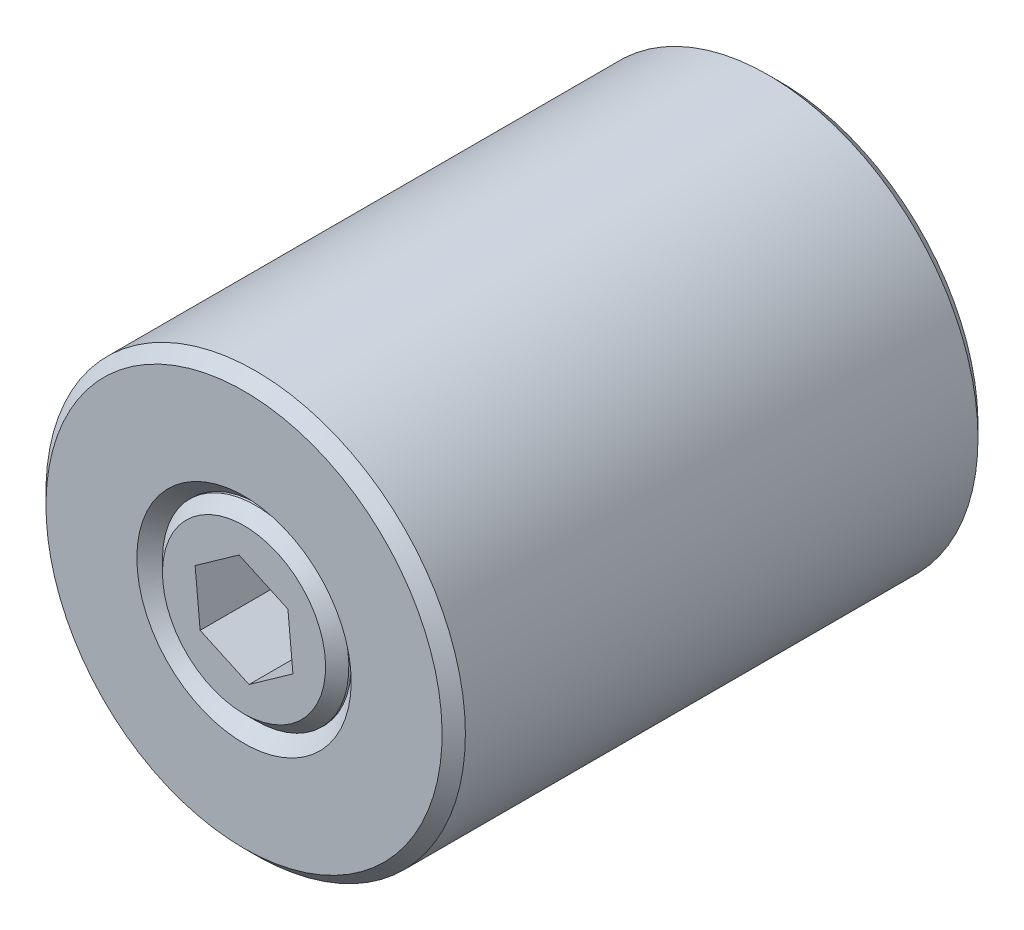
ISO-10303-21;
HEADER;
FILE_DESCRIPTION(('STEP AP214'),'2;1');
FILE_NAME('part.step','',(''),(''),'','','');
FILE_SCHEMA(('AUTOMOTIVE_DESIGN { 1 0 10303 214 1 1 1 1 }'));
ENDSEC;
DATA;
#1=APPLICATION_CONTEXT('core data for automotive mechanical design processes');
#2=APPLICATION_PROTOCOL_DEFINITION('international standard','automotive_design',2000,#1);
#3=PRODUCT_CONTEXT('',#1,'mechanical');
#4=PRODUCT('Part','Part','',(#3));
#5=PRODUCT_RELATED_PRODUCT_CATEGORY('part','',(#4));
#6=PRODUCT_DEFINITION_FORMATION('','',#4);
#7=PRODUCT_DEFINITION_CONTEXT('part definition',#1,'design');
#8=PRODUCT_DEFINITION('design','',#6,#7);
#9=PRODUCT_DEFINITION_SHAPE('','',#8);
#10=(LENGTH_UNIT() NAMED_UNIT(*) SI_UNIT(.MILLI.,.METRE.));
#11=(NAMED_UNIT(*) PLANE_ANGLE_UNIT() SI_UNIT($,.RADIAN.));
#12=(NAMED_UNIT(*) SI_UNIT($,.STERADIAN.) SOLID_ANGLE_UNIT());
#13=UNCERTAINTY_MEASURE_WITH_UNIT(LENGTH_MEASURE(1.E-05),#10,'distance_accuracy_value','');
#14=(GEOMETRIC_REPRESENTATION_CONTEXT(3) GLOBAL_UNCERTAINTY_ASSIGNED_CONTEXT((#13)) GLOBAL_UNIT_ASSIGNED_CONTEXT((#10,
#11,#12)) REPRESENTATION_CONTEXT('',''));
#15=CARTESIAN_POINT('',(0.,0.,0.));
#16=DIRECTION('',(0.,0.,1.));
#17=DIRECTION('',(1.,0.,0.));
#18=AXIS2_PLACEMENT_3D('',#15,#16,#17);
#19=CARTESIAN_POINT('',(2.31410239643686,-3.2626569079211,19.));
#20=DIRECTION('',(0.,0.,1.));
#21=DIRECTION('',(-0.99564874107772,-0.0931857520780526,0.));
#22=AXIS2_PLACEMENT_3D('',#19,#20,#21);
#23=PLANE('',#22);
#24=DIRECTION('',(0.908849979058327,-0.417123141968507,0.));
#25=VECTOR('',#24,1.);
#26=CARTESIAN_POINT('',(-1.88369584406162,-1.33604764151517,19.));
#27=LINE('',#26,#25);
#28=CARTESIAN_POINT('',(-1.88369584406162,-1.33604764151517,19.));
#29=VERTEX_POINT('',#28);
#30=CARTESIAN_POINT('',(0.21520327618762,-2.29935227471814,19.));
#31=VERTEX_POINT('',#30);
#32=EDGE_CURVE('E102',#29,#31,#27,.T.);
#33=ORIENTED_EDGE('',*,*,#32,.T.);
#34=DIRECTION('',(0.815664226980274,0.578525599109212,0.));
#35=VECTOR('',#34,1.);
#36=CARTESIAN_POINT('',(0.21520327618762,-2.29935227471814,19.));
#37=LINE('',#36,#35);
#38=CARTESIAN_POINT('',(2.09889912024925,-0.963304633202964,19.));
#39=VERTEX_POINT('',#38);
#40=EDGE_CURVE('E105',#31,#39,#37,.T.);
#41=ORIENTED_EDGE('',*,*,#40,.T.);
#42=DIRECTION('',(-0.0931857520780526,0.99564874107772,0.));
#43=VECTOR('',#42,1.);
#44=CARTESIAN_POINT('',(2.09889912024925,-0.963304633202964,19.));
#45=LINE('',#44,#43);
#46=CARTESIAN_POINT('',(1.88369584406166,1.33604764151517,19.));
#47=VERTEX_POINT('',#46);
#48=EDGE_CURVE('E77',#39,#47,#45,.T.);
#49=ORIENTED_EDGE('',*,*,#48,.T.);
#50=DIRECTION('',(-0.908849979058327,0.417123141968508,0.));
#51=VECTOR('',#50,1.);
#52=CARTESIAN_POINT('',(1.88369584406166,1.33604764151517,19.));
#53=LINE('',#52,#51);
#54=CARTESIAN_POINT('',(-0.215203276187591,2.29935227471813,19.));
#55=VERTEX_POINT('',#54);
#56=EDGE_CURVE('E108',#47,#55,#53,.T.);
#57=ORIENTED_EDGE('',*,*,#56,.T.);
#58=DIRECTION('',(-0.815664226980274,-0.578525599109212,0.));
#59=VECTOR('',#58,1.);
#60=CARTESIAN_POINT('',(-0.215203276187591,2.29935227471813,19.));
#61=LINE('',#60,#59);
#62=CARTESIAN_POINT('',(-2.09889912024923,0.963304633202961,19.));
#63=VERTEX_POINT('',#62);
#64=EDGE_CURVE('E111',#55,#63,#61,.T.);
#65=ORIENTED_EDGE('',*,*,#64,.T.);
#66=DIRECTION('',(0.0931857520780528,-0.99564874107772,0.));
#67=VECTOR('',#66,1.);
#68=CARTESIAN_POINT('',(-2.09889912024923,0.963304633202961,19.));
#69=LINE('',#68,#67);
#70=EDGE_CURVE('E114',#63,#29,#69,.T.);
#71=ORIENTED_EDGE('',*,*,#70,.T.);
#72=EDGE_LOOP('',(#33,#41,#49,#57,#65,#71));
#73=FACE_BOUND('',#72,.T.);
#74=ADVANCED_FACE('F14',(#73),#23,.T.);
#75=CARTESIAN_POINT('',(0.21520327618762,-2.29935227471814,19.));
#76=DIRECTION('',(0.578525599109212,-0.815664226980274,0.));
#77=DIRECTION('',(0.815664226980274,0.578525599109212,0.));
#78=AXIS2_PLACEMENT_3D('',#75,#76,#77);
#79=PLANE('',#78);
#80=DIRECTION('',(0.815664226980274,0.578525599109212,0.));
#81=VECTOR('',#80,1.);
#82=CARTESIAN_POINT('',(0.215203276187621,-2.29935227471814,23.));
#83=LINE('',#82,#81);
#84=CARTESIAN_POINT('',(0.215203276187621,-2.29935227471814,23.));
#85=VERTEX_POINT('',#84);
#86=CARTESIAN_POINT('',(2.09889912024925,-0.963304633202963,23.));
#87=VERTEX_POINT('',#86);
#88=EDGE_CURVE('E85',#85,#87,#83,.T.);
#89=ORIENTED_EDGE('',*,*,#88,.T.);
#90=DIRECTION('',(0.,0.,1.));
#91=VECTOR('',#90,1.);
#92=CARTESIAN_POINT('',(2.09889912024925,-0.963304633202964,19.));
#93=LINE('',#92,#91);
#94=EDGE_CURVE('E70',#39,#87,#93,.T.);
#95=ORIENTED_EDGE('',*,*,#94,.F.);
#96=ORIENTED_EDGE('',*,*,#40,.F.);
#97=DIRECTION('',(0.,0.,1.));
#98=VECTOR('',#97,1.);
#99=CARTESIAN_POINT('',(0.21520327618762,-2.29935227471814,19.));
#100=LINE('',#99,#98);
#101=EDGE_CURVE('E82',#31,#85,#100,.T.);
#102=ORIENTED_EDGE('',*,*,#101,.T.);
#103=EDGE_LOOP('',(#89,#95,#96,#102));
#104=FACE_BOUND('',#103,.T.);
#105=ADVANCED_FACE('F86',(#104),#79,.F.);
#106=CARTESIAN_POINT('',(2.09889912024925,-0.963304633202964,19.));
#107=DIRECTION('',(0.99564874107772,0.0931857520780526,0.));
#108=DIRECTION('',(0.,0.,1.));
#109=AXIS2_PLACEMENT_3D('',#106,#107,#108);
#110=PLANE('',#109);
#111=DIRECTION('',(-0.0931857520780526,0.99564874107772,0.));
#112=VECTOR('',#111,1.);
#113=CARTESIAN_POINT('',(2.09889912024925,-0.963304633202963,23.));
#114=LINE('',#113,#112);
#115=CARTESIAN_POINT('',(1.88369584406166,1.33604764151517,23.));
#116=VERTEX_POINT('',#115);
#117=EDGE_CURVE('E74',#87,#116,#114,.T.);
#118=ORIENTED_EDGE('',*,*,#117,.T.);
#119=DIRECTION('',(0.,0.,1.));
#120=VECTOR('',#119,1.);
#121=CARTESIAN_POINT('',(1.88369584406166,1.33604764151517,19.));
#122=LINE('',#121,#120);
#123=EDGE_CURVE('E81',#47,#116,#122,.T.);
#124=ORIENTED_EDGE('',*,*,#123,.F.);
#125=ORIENTED_EDGE('',*,*,#48,.F.);
#126=ORIENTED_EDGE('',*,*,#94,.T.);
#127=EDGE_LOOP('',(#118,#124,#125,#126));
#128=FACE_BOUND('',#127,.T.);
#129=ADVANCED_FACE('F72',(#128),#110,.F.);
#130=CARTESIAN_POINT('',(1.88369584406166,1.33604764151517,19.));
#131=DIRECTION('',(0.417123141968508,0.908849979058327,0.));
#132=DIRECTION('',(-0.908849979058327,0.417123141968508,0.));
#133=AXIS2_PLACEMENT_3D('',#130,#131,#132);
#134=PLANE('',#133);
#135=DIRECTION('',(-0.908849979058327,0.417123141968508,0.));
#136=VECTOR('',#135,1.);
#137=CARTESIAN_POINT('',(1.88369584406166,1.33604764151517,23.));
#138=LINE('',#137,#136);
#139=CARTESIAN_POINT('',(-0.215203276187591,2.29935227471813,23.));
#140=VERTEX_POINT('',#139);
#141=EDGE_CURVE('E92',#116,#140,#138,.T.);
#142=ORIENTED_EDGE('',*,*,#141,.T.);
#143=DIRECTION('',(0.,0.,1.));
#144=VECTOR('',#143,1.);
#145=CARTESIAN_POINT('',(-0.215203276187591,2.29935227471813,19.));
#146=LINE('',#145,#144);
#147=EDGE_CURVE('E121',#55,#140,#146,.T.);
#148=ORIENTED_EDGE('',*,*,#147,.F.);
#149=ORIENTED_EDGE('',*,*,#56,.F.);
#150=ORIENTED_EDGE('',*,*,#123,.T.);
#151=EDGE_LOOP('',(#142,#148,#149,#150));
#152=FACE_BOUND('',#151,.T.);
#153=ADVANCED_FACE('F265',(#152),#134,.F.);
#154=CARTESIAN_POINT('',(-0.215203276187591,2.29935227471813,19.));
#155=DIRECTION('',(-0.578525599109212,0.815664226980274,0.));
#156=DIRECTION('',(-0.815664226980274,-0.578525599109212,0.));
#157=AXIS2_PLACEMENT_3D('',#154,#155,#156);
#158=PLANE('',#157);
#159=DIRECTION('',(-0.815664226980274,-0.578525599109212,0.));
#160=VECTOR('',#159,1.);
#161=CARTESIAN_POINT('',(-0.215203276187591,2.29935227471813,23.));
#162=LINE('',#161,#160);
#163=CARTESIAN_POINT('',(-2.09889912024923,0.963304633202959,23.));
#164=VERTEX_POINT('',#163);
#165=EDGE_CURVE('E94',#140,#164,#162,.T.);
#166=ORIENTED_EDGE('',*,*,#165,.T.);
#167=DIRECTION('',(0.,0.,1.));
#168=VECTOR('',#167,1.);
#169=CARTESIAN_POINT('',(-2.09889912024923,0.963304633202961,19.));
#170=LINE('',#169,#168);
#171=EDGE_CURVE('E119',#63,#164,#170,.T.);
#172=ORIENTED_EDGE('',*,*,#171,.F.);
#173=ORIENTED_EDGE('',*,*,#64,.F.);
#174=ORIENTED_EDGE('',*,*,#147,.T.);
#175=EDGE_LOOP('',(#166,#172,#173,#174));
#176=FACE_BOUND('',#175,.T.);
#177=ADVANCED_FACE('F256',(#176),#158,.F.);
#178=CARTESIAN_POINT('',(-2.09889912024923,0.963304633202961,19.));
#179=DIRECTION('',(-0.99564874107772,-0.0931857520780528,0.));
#180=DIRECTION('',(0.0931857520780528,-0.99564874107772,0.));
#181=AXIS2_PLACEMENT_3D('',#178,#179,#180);
#182=PLANE('',#181);
#183=DIRECTION('',(0.0931857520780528,-0.99564874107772,0.));
#184=VECTOR('',#183,1.);
#185=CARTESIAN_POINT('',(-2.09889912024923,0.963304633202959,23.));
#186=LINE('',#185,#184);
#187=CARTESIAN_POINT('',(-1.88369584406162,-1.33604764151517,23.));
#188=VERTEX_POINT('',#187);
#189=EDGE_CURVE('E100',#164,#188,#186,.T.);
#190=ORIENTED_EDGE('',*,*,#189,.T.);
#191=DIRECTION('',(0.,0.,1.));
#192=VECTOR('',#191,1.);
#193=CARTESIAN_POINT('',(-1.88369584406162,-1.33604764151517,19.));
#194=LINE('',#193,#192);
#195=EDGE_CURVE('E38',#29,#188,#194,.T.);
#196=ORIENTED_EDGE('',*,*,#195,.F.);
#197=ORIENTED_EDGE('',*,*,#70,.F.);
#198=ORIENTED_EDGE('',*,*,#171,.T.);
#199=EDGE_LOOP('',(#190,#196,#197,#198));
#200=FACE_BOUND('',#199,.T.);
#201=ADVANCED_FACE('F247',(#200),#182,.F.);
#202=CARTESIAN_POINT('',(-1.88369584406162,-1.33604764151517,19.));
#203=DIRECTION('',(-0.417123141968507,-0.908849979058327,0.));
#204=DIRECTION('',(0.908849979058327,-0.417123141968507,0.));
#205=AXIS2_PLACEMENT_3D('',#202,#203,#204);
#206=PLANE('',#205);
#207=DIRECTION('',(0.908849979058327,-0.417123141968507,0.));
#208=VECTOR('',#207,1.);
#209=CARTESIAN_POINT('',(-1.88369584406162,-1.33604764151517,23.));
#210=LINE('',#209,#208);
#211=EDGE_CURVE('E31',#188,#85,#210,.T.);
#212=ORIENTED_EDGE('',*,*,#211,.T.);
#213=ORIENTED_EDGE('',*,*,#101,.F.);
#214=ORIENTED_EDGE('',*,*,#32,.F.);
#215=ORIENTED_EDGE('',*,*,#195,.T.);
#216=EDGE_LOOP('',(#212,#213,#214,#215));
#217=FACE_BOUND('',#216,.T.);
#218=ADVANCED_FACE('F239',(#217),#206,.F.);
#219=CARTESIAN_POINT('',(0.,0.,23.));
#220=DIRECTION('',(0.,0.,1.));
#221=DIRECTION('',(-0.99564874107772,-0.0931857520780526,0.));
#222=AXIS2_PLACEMENT_3D('',#219,#220,#221);
#223=PLANE('',#222);
#224=CARTESIAN_POINT('',(0.,0.,23.));
#225=DIRECTION('',(0.,0.,1.));
#226=DIRECTION('',(-0.99564874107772,-0.0931857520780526,0.));
#227=AXIS2_PLACEMENT_3D('',#224,#225,#226);
#228=CIRCLE('',#227,3.5);
#229=CARTESIAN_POINT('',(-3.48477059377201,-0.326150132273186,23.));
#230=VERTEX_POINT('',#229);
#231=EDGE_CURVE('E118',#230,#230,#228,.T.);
#232=ORIENTED_EDGE('',*,*,#231,.T.);
#233=EDGE_LOOP('',(#232));
#234=FACE_BOUND('',#233,.T.);
#235=ORIENTED_EDGE('',*,*,#211,.F.);
#236=ORIENTED_EDGE('',*,*,#189,.F.);
#237=ORIENTED_EDGE('',*,*,#165,.F.);
#238=ORIENTED_EDGE('',*,*,#141,.F.);
#239=ORIENTED_EDGE('',*,*,#117,.F.);
#240=ORIENTED_EDGE('',*,*,#88,.F.);
#241=EDGE_LOOP('',(#235,#236,#237,#238,#239,#240));
#242=FACE_BOUND('',#241,.T.);
#243=ADVANCED_FACE('F89',(#234,#242),#223,.T.);
#244=CARTESIAN_POINT('',(0.,0.,23.));
#245=DIRECTION('',(0.,0.,-1.));
#246=DIRECTION('',(0.99564874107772,0.0931857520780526,0.));
#247=AXIS2_PLACEMENT_3D('',#244,#245,#246);
#248=CONICAL_SURFACE('',#247,3.5,0.785398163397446);
#249=CARTESIAN_POINT('',(0.,0.,22.5));
#250=DIRECTION('',(0.,0.,1.));
#251=DIRECTION('',(-0.99564874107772,-0.0931857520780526,0.));
#252=AXIS2_PLACEMENT_3D('',#249,#250,#251);
#253=CIRCLE('',#252,4.);
#254=CARTESIAN_POINT('',(-3.98259496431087,-0.372743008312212,22.5));
#255=VERTEX_POINT('',#254);
#256=EDGE_CURVE('E18',#255,#255,#253,.F.);
#257=ORIENTED_EDGE('',*,*,#256,.F.);
#258=EDGE_LOOP('',(#257));
#259=FACE_BOUND('',#258,.T.);
#260=ORIENTED_EDGE('',*,*,#231,.F.);
#261=EDGE_LOOP('',(#260));
#262=FACE_BOUND('',#261,.T.);
#263=ADVANCED_FACE('F222',(#259,#262),#248,.T.);
#264=CARTESIAN_POINT('',(0.,0.,23.));
#265=DIRECTION('',(0.,0.,-1.));
#266=DIRECTION('',(0.99564874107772,0.0931857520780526,0.));
#267=AXIS2_PLACEMENT_3D('',#264,#265,#266);
#268=CYLINDRICAL_SURFACE('',#267,4.);
#269=ORIENTED_EDGE('',*,*,#256,.T.);
#270=EDGE_LOOP('',(#269));
#271=FACE_BOUND('',#270,.T.);
#272=CARTESIAN_POINT('',(0.,0.,22.4));
#273=DIRECTION('',(0.,0.,1.));
#274=DIRECTION('',(0.,-1.,0.));
#275=AXIS2_PLACEMENT_3D('',#272,#273,#274);
#276=CIRCLE('',#275,4.);
#277=CARTESIAN_POINT('',(0.,-4.,22.4));
#278=VERTEX_POINT('',#277);
#279=EDGE_CURVE('E9',#278,#278,#276,.T.);
#280=ORIENTED_EDGE('',*,*,#279,.T.);
#281=EDGE_LOOP('',(#280));
#282=FACE_BOUND('',#281,.T.);
#283=ADVANCED_FACE('F16',(#271,#282),#268,.T.);
#284=CARTESIAN_POINT('',(0.,0.,23.));
#285=DIRECTION('',(0.,0.,1.));
#286=DIRECTION('',(-0.792668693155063,0.609652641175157,0.));
#287=AXIS2_PLACEMENT_3D('',#284,#285,#286);
#288=CONICAL_SURFACE('',#287,4.6,0.785398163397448);
#289=CARTESIAN_POINT('',(0.,0.,23.));
#290=DIRECTION('',(0.,0.,1.));
#291=DIRECTION('',(-0.792668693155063,0.609652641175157,0.));
#292=AXIS2_PLACEMENT_3D('',#289,#290,#291);
#293=CIRCLE('',#292,4.6);
#294=CARTESIAN_POINT('',(-3.64627598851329,2.80440214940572,23.));
#295=VERTEX_POINT('',#294);
#296=EDGE_CURVE('E128',#295,#295,#293,.T.);
#297=ORIENTED_EDGE('',*,*,#296,.T.);
#298=EDGE_LOOP('',(#297));
#299=FACE_BOUND('',#298,.T.);
#300=ORIENTED_EDGE('',*,*,#279,.F.);
#301=EDGE_LOOP('',(#300));
#302=FACE_BOUND('',#301,.T.);
#303=ADVANCED_FACE('F161',(#299,#302),#288,.F.);
#304=CARTESIAN_POINT('',(0.,0.,23.));
#305=DIRECTION('',(0.,0.,1.));
#306=DIRECTION('',(-0.792668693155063,0.609652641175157,0.));
#307=AXIS2_PLACEMENT_3D('',#304,#305,#306);
#308=PLANE('',#307);
#309=CARTESIAN_POINT('',(0.,0.,23.));
#310=DIRECTION('',(0.,0.,1.));
#311=DIRECTION('',(-0.792668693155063,0.609652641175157,0.));
#312=AXIS2_PLACEMENT_3D('',#309,#310,#311);
#313=CIRCLE('',#312,8.5);
#314=CARTESIAN_POINT('',(-6.73768389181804,5.18204744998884,23.));
#315=VERTEX_POINT('',#314);
#316=EDGE_CURVE('E132',#315,#315,#313,.T.);
#317=ORIENTED_EDGE('',*,*,#316,.T.);
#318=EDGE_LOOP('',(#317));
#319=FACE_BOUND('',#318,.T.);
#320=ORIENTED_EDGE('',*,*,#296,.F.);
#321=EDGE_LOOP('',(#320));
#322=FACE_BOUND('',#321,.T.);
#323=ADVANCED_FACE('F162',(#319,#322),#308,.T.);
#324=CARTESIAN_POINT('',(0.,0.,23.));
#325=DIRECTION('',(0.,0.,-1.));
#326=DIRECTION('',(0.792668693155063,-0.609652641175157,0.));
#327=AXIS2_PLACEMENT_3D('',#324,#325,#326);
#328=CONICAL_SURFACE('',#327,8.5,0.78539816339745);
#329=CARTESIAN_POINT('',(0.,0.,22.5));
#330=DIRECTION('',(0.,0.,1.));
#331=DIRECTION('',(-0.792668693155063,0.609652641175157,0.));
#332=AXIS2_PLACEMENT_3D('',#329,#330,#331);
#333=CIRCLE('',#332,9.);
#334=CARTESIAN_POINT('',(-7.13401823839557,5.48687377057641,22.5));
#335=VERTEX_POINT('',#334);
#336=EDGE_CURVE('E137',#335,#335,#333,.F.);
#337=ORIENTED_EDGE('',*,*,#336,.F.);
#338=EDGE_LOOP('',(#337));
#339=FACE_BOUND('',#338,.T.);
#340=ORIENTED_EDGE('',*,*,#316,.F.);
#341=EDGE_LOOP('',(#340));
#342=FACE_BOUND('',#341,.T.);
#343=ADVANCED_FACE('F155',(#339,#342),#328,.T.);
#344=CARTESIAN_POINT('',(0.,0.,23.));
#345=DIRECTION('',(0.,0.,-1.));
#346=DIRECTION('',(0.792668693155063,-0.609652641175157,0.));
#347=AXIS2_PLACEMENT_3D('',#344,#345,#346);
#348=CYLINDRICAL_SURFACE('',#347,9.);
#349=CARTESIAN_POINT('',(0.,0.,0.5));
#350=DIRECTION('',(0.,0.,1.));
#351=DIRECTION('',(-0.792668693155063,0.609652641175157,0.));
#352=AXIS2_PLACEMENT_3D('',#349,#350,#351);
#353=CIRCLE('',#352,9.);
#354=CARTESIAN_POINT('',(-7.13401823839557,5.48687377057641,0.5));
#355=VERTEX_POINT('',#354);
#356=EDGE_CURVE('E142',#355,#355,#353,.T.);
#357=ORIENTED_EDGE('',*,*,#356,.T.);
#358=EDGE_LOOP('',(#357));
#359=FACE_BOUND('',#358,.T.);
#360=ORIENTED_EDGE('',*,*,#336,.T.);
#361=EDGE_LOOP('',(#360));
#362=FACE_BOUND('',#361,.T.);
#363=ADVANCED_FACE('F153',(#359,#362),#348,.T.);
#364=CARTESIAN_POINT('',(0.,0.,0.5));
#365=DIRECTION('',(0.,0.,1.));
#366=DIRECTION('',(-0.792668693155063,0.609652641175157,0.));
#367=AXIS2_PLACEMENT_3D('',#364,#365,#366);
#368=CONICAL_SURFACE('',#367,9.,0.78539816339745);
#369=CARTESIAN_POINT('',(0.,0.,0.));
#370=DIRECTION('',(0.,0.,1.));
#371=DIRECTION('',(-0.792668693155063,0.609652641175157,0.));
#372=AXIS2_PLACEMENT_3D('',#369,#370,#371);
#373=CIRCLE('',#372,8.5);
#374=CARTESIAN_POINT('',(-6.73768389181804,5.18204744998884,0.));
#375=VERTEX_POINT('',#374);
#376=EDGE_CURVE('E23',#375,#375,#373,.F.);
#377=ORIENTED_EDGE('',*,*,#376,.F.);
#378=EDGE_LOOP('',(#377));
#379=FACE_BOUND('',#378,.T.);
#380=ORIENTED_EDGE('',*,*,#356,.F.);
#381=EDGE_LOOP('',(#380));
#382=FACE_BOUND('',#381,.T.);
#383=ADVANCED_FACE('F150',(#379,#382),#368,.T.);
#384=CARTESIAN_POINT('',(0.,0.,0.));
#385=DIRECTION('',(0.,0.,1.));
#386=DIRECTION('',(-0.792668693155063,0.609652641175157,0.));
#387=AXIS2_PLACEMENT_3D('',#384,#385,#386);
#388=PLANE('',#387);
#389=ORIENTED_EDGE('',*,*,#376,.T.);
#390=EDGE_LOOP('',(#389));
#391=FACE_BOUND('',#390,.T.);
#392=ADVANCED_FACE('F148',(#391),#388,.F.);
#393=CLOSED_SHELL('',(#74,#105,#129,#153,#177,#201,#218,#243,#263,#283,#303,#323,#343,#363,#383,#392));
#394=MANIFOLD_SOLID_BREP('B1',#393);
#395=ADVANCED_BREP_SHAPE_REPRESENTATION('',(#18,#394),#14);
#396=SHAPE_DEFINITION_REPRESENTATION(#9,#395);
ENDSEC;
END-ISO-10303-21;
